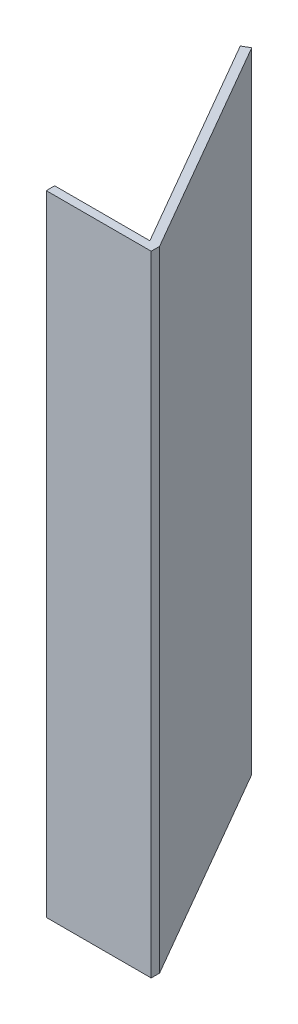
from build123d import *

# Parameters (mm, degrees)
EXTRUDE_1_DEPTH = 150


with BuildPart() as part:
    # Sketch 1 → Extrude 1 (new body)
    with BuildSketch(Plane(origin=(0, 0, 0), x_dir=(1, 0, 0), z_dir=(0, 1, 0))):
        Polygon((0, 0), (25, 0), (25, 2), (-5, 53.961524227), (-6.732050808, 52.961524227), (22.690598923, 2), (0, 2), align=None)
    extrude(amount=EXTRUDE_1_DEPTH)


solid = part.part
